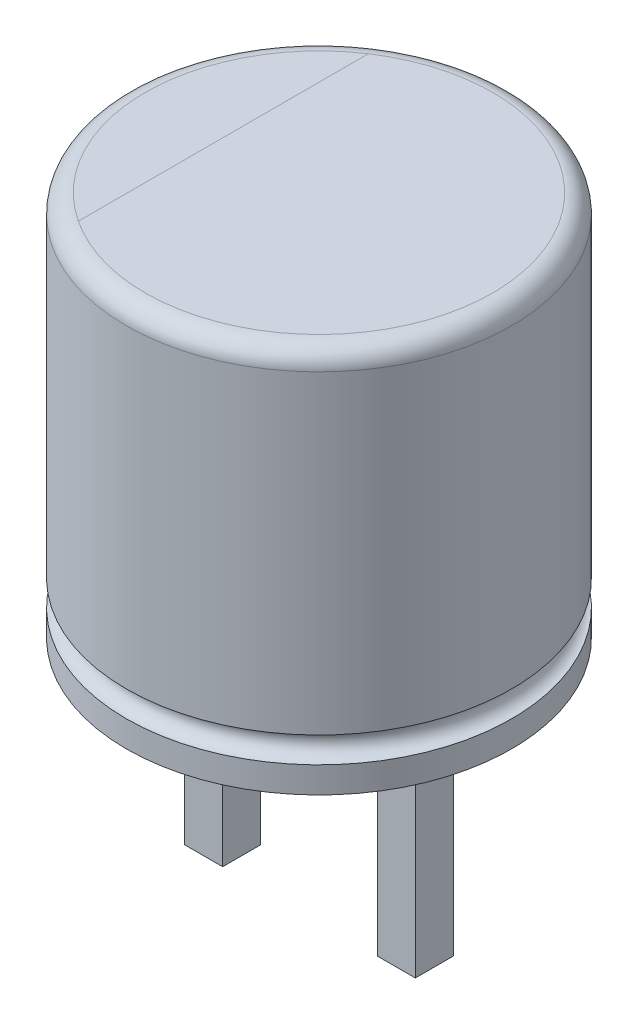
from build123d import *

# Parameters (mm, degrees)
SKETCH2_W      = 0.5
SKETCH2_H      = 0.5
EXTRUDE1_DEPTH = 3


with BuildPart() as part:
    # Sketch1 → Revolve1 (revolve)
    with BuildSketch(Plane.XY, mode=Mode.PRIVATE) as revolve1_sk:
        with BuildLine():
            Line((0, 0), (0, 5.08))
            Line((0, 5.08), (2.29, 5.08))
            ThreePointArc((2.29, 5.08), (2.466776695, 5.006776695), (2.54, 4.83))
            Line((2.54, 4.83), (2.54, 0.684358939))
            ThreePointArc((2.54, 0.684358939), (2.369795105, 0.514154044), (2.54, 0.343949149))
            Line((2.54, 0.343949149), (2.54, 0))
            Line((2.54, 0), (0, 0))
        make_face()
    revolve(revolve1_sk.sketch.rotate(Axis((0, 0, 0), (0, -1, 0)), 90), axis=Axis((0, 0, 0), (0, -1, 0)))

    # Sketch2 → Extrude1 (add)
    with BuildSketch(Plane.XZ):
        with Locations((-1.27, 0)):
            Rectangle(SKETCH2_W, SKETCH2_H)
        with Locations((1.27, 0)):
            Rectangle(SKETCH2_W, SKETCH2_H)
    extrude(amount=EXTRUDE1_DEPTH)


solid = part.part
